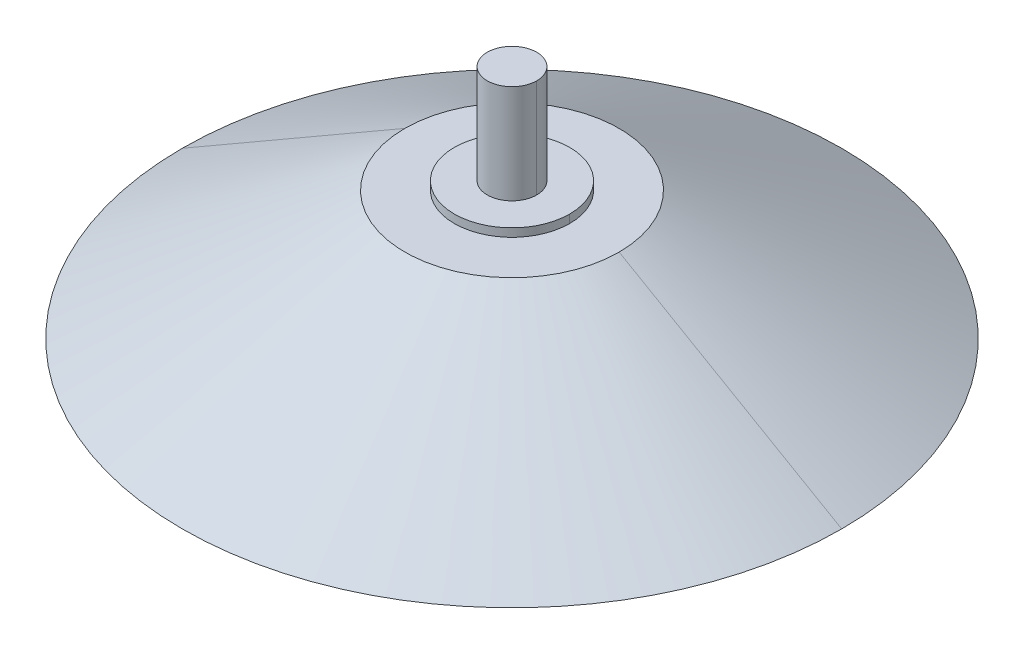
ISO-10303-21;
HEADER;
FILE_DESCRIPTION(('STEP AP214'),'2;1');
FILE_NAME('part.step','',(''),(''),'','','');
FILE_SCHEMA(('AUTOMOTIVE_DESIGN { 1 0 10303 214 1 1 1 1 }'));
ENDSEC;
DATA;
#1=APPLICATION_CONTEXT('core data for automotive mechanical design processes');
#2=APPLICATION_PROTOCOL_DEFINITION('international standard','automotive_design',2000,#1);
#3=PRODUCT_CONTEXT('',#1,'mechanical');
#4=PRODUCT('Part','Part','',(#3));
#5=PRODUCT_RELATED_PRODUCT_CATEGORY('part','',(#4));
#6=PRODUCT_DEFINITION_FORMATION('','',#4);
#7=PRODUCT_DEFINITION_CONTEXT('part definition',#1,'design');
#8=PRODUCT_DEFINITION('design','',#6,#7);
#9=PRODUCT_DEFINITION_SHAPE('','',#8);
#10=(LENGTH_UNIT() NAMED_UNIT(*) SI_UNIT(.MILLI.,.METRE.));
#11=(NAMED_UNIT(*) PLANE_ANGLE_UNIT() SI_UNIT($,.RADIAN.));
#12=(NAMED_UNIT(*) SI_UNIT($,.STERADIAN.) SOLID_ANGLE_UNIT());
#13=UNCERTAINTY_MEASURE_WITH_UNIT(LENGTH_MEASURE(1.E-05),#10,'distance_accuracy_value','');
#14=(GEOMETRIC_REPRESENTATION_CONTEXT(3) GLOBAL_UNCERTAINTY_ASSIGNED_CONTEXT((#13)) GLOBAL_UNIT_ASSIGNED_CONTEXT((#10,
#11,#12)) REPRESENTATION_CONTEXT('',''));
#15=CARTESIAN_POINT('',(0.,0.,0.));
#16=DIRECTION('',(0.,0.,1.));
#17=DIRECTION('',(1.,0.,0.));
#18=AXIS2_PLACEMENT_3D('',#15,#16,#17);
#19=CARTESIAN_POINT('',(0.,6.5,0.));
#20=DIRECTION('',(0.,1.,0.));
#21=DIRECTION('',(1.,0.,0.));
#22=AXIS2_PLACEMENT_3D('',#19,#20,#21);
#23=PLANE('',#22);
#24=CARTESIAN_POINT('',(0.,6.5,0.));
#25=DIRECTION('',(0.,1.,0.));
#26=DIRECTION('',(1.,0.,0.));
#27=AXIS2_PLACEMENT_3D('',#24,#25,#26);
#28=CIRCLE('',#27,1.5);
#29=CARTESIAN_POINT('',(1.5,6.5,0.));
#30=VERTEX_POINT('',#29);
#31=CARTESIAN_POINT('',(-1.5,6.5,0.));
#32=VERTEX_POINT('',#31);
#33=EDGE_CURVE('E166',#30,#32,#28,.T.);
#34=ORIENTED_EDGE('',*,*,#33,.T.);
#35=CARTESIAN_POINT('',(0.,6.5,0.));
#36=DIRECTION('',(0.,-1.,0.));
#37=DIRECTION('',(1.,0.,0.));
#38=AXIS2_PLACEMENT_3D('',#35,#36,#37);
#39=CIRCLE('',#38,1.5);
#40=EDGE_CURVE('E11',#30,#32,#39,.T.);
#41=ORIENTED_EDGE('',*,*,#40,.F.);
#42=EDGE_LOOP('',(#34,#41));
#43=FACE_BOUND('',#42,.T.);
#44=ADVANCED_FACE('F17',(#43),#23,.T.);
#45=CARTESIAN_POINT('',(0.,-8.508940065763,0.));
#46=DIRECTION('',(0.,1.,0.));
#47=DIRECTION('',(1.,0.,0.));
#48=AXIS2_PLACEMENT_3D('',#45,#46,#47);
#49=CYLINDRICAL_SURFACE('',#48,1.5);
#50=ORIENTED_EDGE('',*,*,#40,.T.);
#51=DIRECTION('',(0.,1.,0.));
#52=VECTOR('',#51,1.);
#53=CARTESIAN_POINT('',(-1.5,0.5,0.));
#54=LINE('',#53,#52);
#55=CARTESIAN_POINT('',(-1.5,0.5,0.));
#56=VERTEX_POINT('',#55);
#57=EDGE_CURVE('E192',#56,#32,#54,.T.);
#58=ORIENTED_EDGE('',*,*,#57,.F.);
#59=CARTESIAN_POINT('',(0.,0.5,0.));
#60=DIRECTION('',(0.,-1.,0.));
#61=DIRECTION('',(1.,0.,0.));
#62=AXIS2_PLACEMENT_3D('',#59,#60,#61);
#63=CIRCLE('',#62,1.5);
#64=CARTESIAN_POINT('',(1.5,0.5,0.));
#65=VERTEX_POINT('',#64);
#66=EDGE_CURVE('E117',#65,#56,#63,.T.);
#67=ORIENTED_EDGE('',*,*,#66,.F.);
#68=DIRECTION('',(0.,1.,0.));
#69=VECTOR('',#68,1.);
#70=CARTESIAN_POINT('',(1.5,0.5,0.));
#71=LINE('',#70,#69);
#72=EDGE_CURVE('E28',#65,#30,#71,.T.);
#73=ORIENTED_EDGE('',*,*,#72,.T.);
#74=EDGE_LOOP('',(#50,#58,#67,#73));
#75=FACE_BOUND('',#74,.T.);
#76=ADVANCED_FACE('F273',(#75),#49,.T.);
#77=CARTESIAN_POINT('',(0.,-8.508940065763,0.));
#78=DIRECTION('',(0.,1.,0.));
#79=DIRECTION('',(1.,0.,0.));
#80=AXIS2_PLACEMENT_3D('',#77,#78,#79);
#81=CYLINDRICAL_SURFACE('',#80,1.5);
#82=CARTESIAN_POINT('',(0.,0.5,0.));
#83=DIRECTION('',(0.,1.,0.));
#84=DIRECTION('',(1.,0.,0.));
#85=AXIS2_PLACEMENT_3D('',#82,#83,#84);
#86=CIRCLE('',#85,1.5);
#87=EDGE_CURVE('E164',#65,#56,#86,.T.);
#88=ORIENTED_EDGE('',*,*,#87,.T.);
#89=ORIENTED_EDGE('',*,*,#57,.T.);
#90=ORIENTED_EDGE('',*,*,#33,.F.);
#91=ORIENTED_EDGE('',*,*,#72,.F.);
#92=EDGE_LOOP('',(#88,#89,#90,#91));
#93=FACE_BOUND('',#92,.T.);
#94=ADVANCED_FACE('F19',(#93),#81,.T.);
#95=CARTESIAN_POINT('',(0.,0.5,0.));
#96=DIRECTION('',(0.,1.,0.));
#97=DIRECTION('',(1.,0.,0.));
#98=AXIS2_PLACEMENT_3D('',#95,#96,#97);
#99=PLANE('',#98);
#100=ORIENTED_EDGE('',*,*,#66,.T.);
#101=ORIENTED_EDGE('',*,*,#87,.F.);
#102=EDGE_LOOP('',(#100,#101));
#103=FACE_BOUND('',#102,.T.);
#104=CARTESIAN_POINT('',(0.,0.5,0.));
#105=DIRECTION('',(0.,1.,0.));
#106=DIRECTION('',(1.,0.,0.));
#107=AXIS2_PLACEMENT_3D('',#104,#105,#106);
#108=CIRCLE('',#107,3.5);
#109=CARTESIAN_POINT('',(3.5,0.5,0.));
#110=VERTEX_POINT('',#109);
#111=CARTESIAN_POINT('',(-3.5,0.5,0.));
#112=VERTEX_POINT('',#111);
#113=EDGE_CURVE('E148',#110,#112,#108,.T.);
#114=ORIENTED_EDGE('',*,*,#113,.T.);
#115=CARTESIAN_POINT('',(0.,0.5,0.));
#116=DIRECTION('',(0.,-1.,0.));
#117=DIRECTION('',(1.,0.,0.));
#118=AXIS2_PLACEMENT_3D('',#115,#116,#117);
#119=CIRCLE('',#118,3.5);
#120=EDGE_CURVE('E155',#110,#112,#119,.T.);
#121=ORIENTED_EDGE('',*,*,#120,.F.);
#122=EDGE_LOOP('',(#114,#121));
#123=FACE_BOUND('',#122,.T.);
#124=ADVANCED_FACE('F177',(#103,#123),#99,.T.);
#125=CARTESIAN_POINT('',(0.,-0.5,0.));
#126=DIRECTION('',(0.,1.,0.));
#127=DIRECTION('',(1.,0.,0.));
#128=AXIS2_PLACEMENT_3D('',#125,#126,#127);
#129=PLANE('',#128);
#130=CARTESIAN_POINT('',(0.,-0.5,0.));
#131=DIRECTION('',(0.,1.,0.));
#132=DIRECTION('',(1.,0.,0.));
#133=AXIS2_PLACEMENT_3D('',#130,#131,#132);
#134=CIRCLE('',#133,6.866025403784);
#135=CARTESIAN_POINT('',(6.866025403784,-0.5,0.));
#136=VERTEX_POINT('',#135);
#137=CARTESIAN_POINT('',(-6.866025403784,-0.5,0.));
#138=VERTEX_POINT('',#137);
#139=EDGE_CURVE('E120',#136,#138,#134,.T.);
#140=ORIENTED_EDGE('',*,*,#139,.F.);
#141=CARTESIAN_POINT('',(0.,-0.5,0.));
#142=DIRECTION('',(0.,-1.,0.));
#143=DIRECTION('',(1.,0.,0.));
#144=AXIS2_PLACEMENT_3D('',#141,#142,#143);
#145=CIRCLE('',#144,6.866025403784);
#146=EDGE_CURVE('E109',#136,#138,#145,.T.);
#147=ORIENTED_EDGE('',*,*,#146,.T.);
#148=EDGE_LOOP('',(#140,#147));
#149=FACE_BOUND('',#148,.T.);
#150=ADVANCED_FACE('F125',(#149),#129,.F.);
#151=CARTESIAN_POINT('',(0.,-4.14711431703,0.));
#152=DIRECTION('',(0.,-1.,0.));
#153=DIRECTION('',(-1.,0.,0.));
#154=AXIS2_PLACEMENT_3D('',#151,#152,#153);
#155=CONICAL_SURFACE('',#154,13.18301270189,1.0471975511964);
#156=CARTESIAN_POINT('',(0.,-7.79422863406,0.));
#157=DIRECTION('',(0.,-1.,0.));
#158=DIRECTION('',(1.,0.,0.));
#159=AXIS2_PLACEMENT_3D('',#156,#157,#158);
#160=CIRCLE('',#159,19.5);
#161=CARTESIAN_POINT('',(19.5,-7.79422863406,0.));
#162=VERTEX_POINT('',#161);
#163=CARTESIAN_POINT('',(-19.5,-7.79422863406,0.));
#164=VERTEX_POINT('',#163);
#165=EDGE_CURVE('E134',#162,#164,#160,.T.);
#166=ORIENTED_EDGE('',*,*,#165,.T.);
#167=DIRECTION('',(-0.866025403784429,-0.500000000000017,0.));
#168=VECTOR('',#167,1.);
#169=CARTESIAN_POINT('',(-6.866025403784,-0.5,0.));
#170=LINE('',#169,#168);
#171=EDGE_CURVE('E103',#138,#164,#170,.T.);
#172=ORIENTED_EDGE('',*,*,#171,.F.);
#173=ORIENTED_EDGE('',*,*,#146,.F.);
#174=DIRECTION('',(0.866025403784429,-0.500000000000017,0.));
#175=VECTOR('',#174,1.);
#176=CARTESIAN_POINT('',(6.866025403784,-0.5,0.));
#177=LINE('',#176,#175);
#178=EDGE_CURVE('E113',#136,#162,#177,.T.);
#179=ORIENTED_EDGE('',*,*,#178,.T.);
#180=EDGE_LOOP('',(#166,#172,#173,#179));
#181=FACE_BOUND('',#180,.T.);
#182=ADVANCED_FACE('F112',(#181),#155,.F.);
#183=CARTESIAN_POINT('',(0.,-4.14711431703,0.));
#184=DIRECTION('',(0.,-1.,0.));
#185=DIRECTION('',(-1.,0.,0.));
#186=AXIS2_PLACEMENT_3D('',#183,#184,#185);
#187=CONICAL_SURFACE('',#186,13.18301270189,1.0471975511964);
#188=ORIENTED_EDGE('',*,*,#139,.T.);
#189=ORIENTED_EDGE('',*,*,#171,.T.);
#190=CARTESIAN_POINT('',(0.,-7.79422863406,0.));
#191=DIRECTION('',(0.,1.,0.));
#192=DIRECTION('',(1.,0.,0.));
#193=AXIS2_PLACEMENT_3D('',#190,#191,#192);
#194=CIRCLE('',#193,19.5);
#195=EDGE_CURVE('E121',#162,#164,#194,.T.);
#196=ORIENTED_EDGE('',*,*,#195,.F.);
#197=ORIENTED_EDGE('',*,*,#178,.F.);
#198=EDGE_LOOP('',(#188,#189,#196,#197));
#199=FACE_BOUND('',#198,.T.);
#200=ADVANCED_FACE('F119',(#199),#187,.F.);
#201=CARTESIAN_POINT('',(0.,-7.79422863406,0.));
#202=DIRECTION('',(0.,1.,0.));
#203=DIRECTION('',(1.,0.,0.));
#204=AXIS2_PLACEMENT_3D('',#201,#202,#203);
#205=PLANE('',#204);
#206=ORIENTED_EDGE('',*,*,#165,.F.);
#207=ORIENTED_EDGE('',*,*,#195,.T.);
#208=EDGE_LOOP('',(#206,#207));
#209=FACE_BOUND('',#208,.T.);
#210=CARTESIAN_POINT('',(0.,-7.79422863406,0.));
#211=DIRECTION('',(0.,1.,0.));
#212=DIRECTION('',(1.,0.,0.));
#213=AXIS2_PLACEMENT_3D('',#210,#211,#212);
#214=CIRCLE('',#213,20.);
#215=CARTESIAN_POINT('',(20.,-7.79422863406,0.));
#216=VERTEX_POINT('',#215);
#217=CARTESIAN_POINT('',(-20.,-7.79422863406,0.));
#218=VERTEX_POINT('',#217);
#219=EDGE_CURVE('E140',#216,#218,#214,.T.);
#220=ORIENTED_EDGE('',*,*,#219,.F.);
#221=CARTESIAN_POINT('',(0.,-7.79422863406,0.));
#222=DIRECTION('',(0.,-1.,0.));
#223=DIRECTION('',(1.,0.,0.));
#224=AXIS2_PLACEMENT_3D('',#221,#222,#223);
#225=CIRCLE('',#224,20.);
#226=EDGE_CURVE('E159',#216,#218,#225,.T.);
#227=ORIENTED_EDGE('',*,*,#226,.T.);
#228=EDGE_LOOP('',(#220,#227));
#229=FACE_BOUND('',#228,.T.);
#230=ADVANCED_FACE('F211',(#209,#229),#205,.F.);
#231=CARTESIAN_POINT('',(0.,-3.89711431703,0.));
#232=DIRECTION('',(0.,-1.,0.));
#233=DIRECTION('',(-1.,0.,0.));
#234=AXIS2_PLACEMENT_3D('',#231,#232,#233);
#235=CONICAL_SURFACE('',#234,13.25,1.0471975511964);
#236=CARTESIAN_POINT('',(0.,0.,0.));
#237=DIRECTION('',(0.,-1.,0.));
#238=DIRECTION('',(1.,0.,0.));
#239=AXIS2_PLACEMENT_3D('',#236,#237,#238);
#240=CIRCLE('',#239,6.5);
#241=CARTESIAN_POINT('',(6.5,0.,0.));
#242=VERTEX_POINT('',#241);
#243=CARTESIAN_POINT('',(-6.5,0.,0.));
#244=VERTEX_POINT('',#243);
#245=EDGE_CURVE('E147',#242,#244,#240,.T.);
#246=ORIENTED_EDGE('',*,*,#245,.T.);
#247=DIRECTION('',(0.866025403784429,0.500000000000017,0.));
#248=VECTOR('',#247,1.);
#249=CARTESIAN_POINT('',(-20.,-7.79422863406,0.));
#250=LINE('',#249,#248);
#251=EDGE_CURVE('E138',#218,#244,#250,.T.);
#252=ORIENTED_EDGE('',*,*,#251,.F.);
#253=ORIENTED_EDGE('',*,*,#226,.F.);
#254=DIRECTION('',(-0.866025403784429,0.500000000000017,0.));
#255=VECTOR('',#254,1.);
#256=CARTESIAN_POINT('',(20.,-7.79422863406,0.));
#257=LINE('',#256,#255);
#258=EDGE_CURVE('E156',#216,#242,#257,.T.);
#259=ORIENTED_EDGE('',*,*,#258,.T.);
#260=EDGE_LOOP('',(#246,#252,#253,#259));
#261=FACE_BOUND('',#260,.T.);
#262=ADVANCED_FACE('F215',(#261),#235,.T.);
#263=CARTESIAN_POINT('',(0.,-3.89711431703,0.));
#264=DIRECTION('',(0.,-1.,0.));
#265=DIRECTION('',(-1.,0.,0.));
#266=AXIS2_PLACEMENT_3D('',#263,#264,#265);
#267=CONICAL_SURFACE('',#266,13.25,1.0471975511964);
#268=ORIENTED_EDGE('',*,*,#219,.T.);
#269=ORIENTED_EDGE('',*,*,#251,.T.);
#270=CARTESIAN_POINT('',(0.,0.,0.));
#271=DIRECTION('',(0.,1.,0.));
#272=DIRECTION('',(1.,0.,0.));
#273=AXIS2_PLACEMENT_3D('',#270,#271,#272);
#274=CIRCLE('',#273,6.5);
#275=EDGE_CURVE('E143',#242,#244,#274,.T.);
#276=ORIENTED_EDGE('',*,*,#275,.F.);
#277=ORIENTED_EDGE('',*,*,#258,.F.);
#278=EDGE_LOOP('',(#268,#269,#276,#277));
#279=FACE_BOUND('',#278,.T.);
#280=ADVANCED_FACE('F219',(#279),#267,.T.);
#281=CARTESIAN_POINT('',(0.,0.,0.));
#282=DIRECTION('',(0.,1.,0.));
#283=DIRECTION('',(1.,0.,0.));
#284=AXIS2_PLACEMENT_3D('',#281,#282,#283);
#285=PLANE('',#284);
#286=CARTESIAN_POINT('',(0.,0.,0.));
#287=DIRECTION('',(0.,1.,0.));
#288=DIRECTION('',(1.,0.,0.));
#289=AXIS2_PLACEMENT_3D('',#286,#287,#288);
#290=CIRCLE('',#289,3.5);
#291=CARTESIAN_POINT('',(3.5,0.,0.));
#292=VERTEX_POINT('',#291);
#293=CARTESIAN_POINT('',(-3.5,0.,0.));
#294=VERTEX_POINT('',#293);
#295=EDGE_CURVE('E180',#292,#294,#290,.T.);
#296=ORIENTED_EDGE('',*,*,#295,.F.);
#297=CARTESIAN_POINT('',(0.,0.,0.));
#298=DIRECTION('',(0.,-1.,0.));
#299=DIRECTION('',(1.,0.,0.));
#300=AXIS2_PLACEMENT_3D('',#297,#298,#299);
#301=CIRCLE('',#300,3.5);
#302=EDGE_CURVE('E73',#292,#294,#301,.T.);
#303=ORIENTED_EDGE('',*,*,#302,.T.);
#304=EDGE_LOOP('',(#296,#303));
#305=FACE_BOUND('',#304,.T.);
#306=ORIENTED_EDGE('',*,*,#245,.F.);
#307=ORIENTED_EDGE('',*,*,#275,.T.);
#308=EDGE_LOOP('',(#306,#307));
#309=FACE_BOUND('',#308,.T.);
#310=ADVANCED_FACE('F316',(#305,#309),#285,.T.);
#311=CARTESIAN_POINT('',(0.,-8.508940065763,0.));
#312=DIRECTION('',(0.,1.,0.));
#313=DIRECTION('',(1.,0.,0.));
#314=AXIS2_PLACEMENT_3D('',#311,#312,#313);
#315=CYLINDRICAL_SURFACE('',#314,3.5);
#316=ORIENTED_EDGE('',*,*,#120,.T.);
#317=DIRECTION('',(0.,1.,0.));
#318=VECTOR('',#317,1.);
#319=CARTESIAN_POINT('',(-3.5,0.,0.));
#320=LINE('',#319,#318);
#321=EDGE_CURVE('E21',#294,#112,#320,.T.);
#322=ORIENTED_EDGE('',*,*,#321,.F.);
#323=ORIENTED_EDGE('',*,*,#302,.F.);
#324=DIRECTION('',(0.,1.,0.));
#325=VECTOR('',#324,1.);
#326=CARTESIAN_POINT('',(3.5,0.,0.));
#327=LINE('',#326,#325);
#328=EDGE_CURVE('E152',#292,#110,#327,.T.);
#329=ORIENTED_EDGE('',*,*,#328,.T.);
#330=EDGE_LOOP('',(#316,#322,#323,#329));
#331=FACE_BOUND('',#330,.T.);
#332=ADVANCED_FACE('F172',(#331),#315,.T.);
#333=CARTESIAN_POINT('',(0.,-8.508940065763,0.));
#334=DIRECTION('',(0.,1.,0.));
#335=DIRECTION('',(1.,0.,0.));
#336=AXIS2_PLACEMENT_3D('',#333,#334,#335);
#337=CYLINDRICAL_SURFACE('',#336,3.5);
#338=ORIENTED_EDGE('',*,*,#295,.T.);
#339=ORIENTED_EDGE('',*,*,#321,.T.);
#340=ORIENTED_EDGE('',*,*,#113,.F.);
#341=ORIENTED_EDGE('',*,*,#328,.F.);
#342=EDGE_LOOP('',(#338,#339,#340,#341));
#343=FACE_BOUND('',#342,.T.);
#344=ADVANCED_FACE('F179',(#343),#337,.T.);
#345=CLOSED_SHELL('',(#44,#76,#94,#124,#150,#182,#200,#230,#262,#280,#310,#332,#344));
#346=MANIFOLD_SOLID_BREP('B1',#345);
#347=ADVANCED_BREP_SHAPE_REPRESENTATION('',(#18,#346),#14);
#348=SHAPE_DEFINITION_REPRESENTATION(#9,#347);
ENDSEC;
END-ISO-10303-21;
